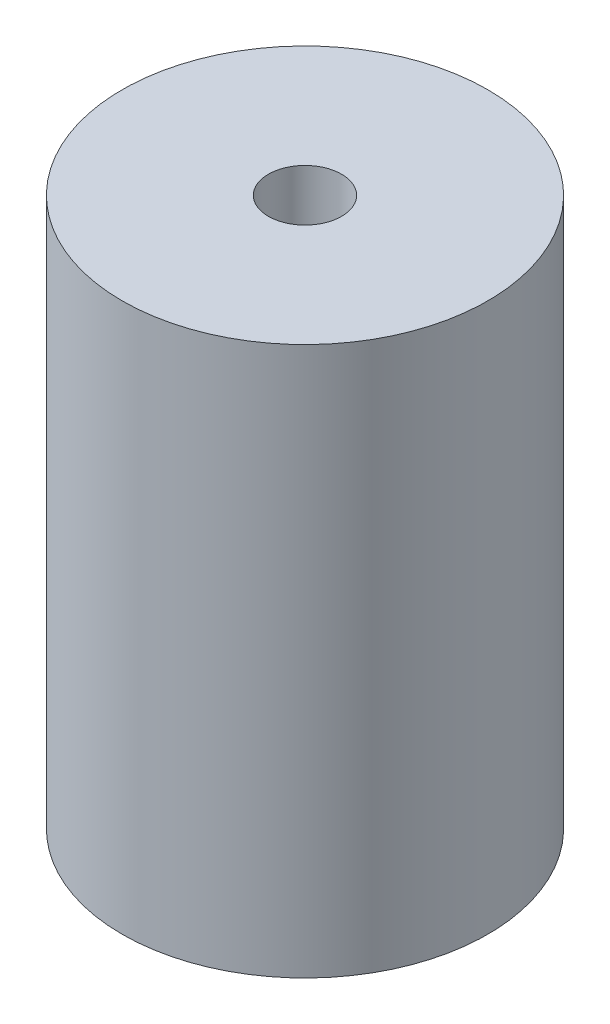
from build123d import *

# Parameters (mm, degrees)
SKETCH_1_R          = 10
EXTRUDE_1_DEPTH     = 30
SKETCH_2_R          = 2
CUT_EXTRUDE_1_DEPTH = 8
SKETCH_3_R          = 4
CUT_EXTRUDE_2_DEPTH = 8


with BuildPart() as part:
    # Sketch 1 → Extrude 1 (new body)
    with BuildSketch(Plane(origin=(0, 0, 0), x_dir=(1, 0, 0), z_dir=(0, 1, 0))):
        with Locations(Location((0, 0, 0), (0, 0, 270))):
            Circle(SKETCH_1_R)
    extrude(amount=EXTRUDE_1_DEPTH)

    # Sketch 2 → Cut-Extrude 1 (cut)
    with BuildSketch(Plane(origin=(0, 30, 0), x_dir=(1, 0, 0), z_dir=(0, 1, 0))):
        with Locations(Location((0, 0, 0), (0, 0, 270))):
            Circle(SKETCH_2_R)
    extrude(amount=-CUT_EXTRUDE_1_DEPTH, mode=Mode.SUBTRACT)

    # Sketch 3 → Cut-Extrude 2 (cut)
    with BuildSketch(Plane.XZ):
        with Locations(Location((0, 0, 0), (0, 0, 270))):
            Circle(SKETCH_3_R)
    extrude(amount=-CUT_EXTRUDE_2_DEPTH, mode=Mode.SUBTRACT)


solid = part.part
